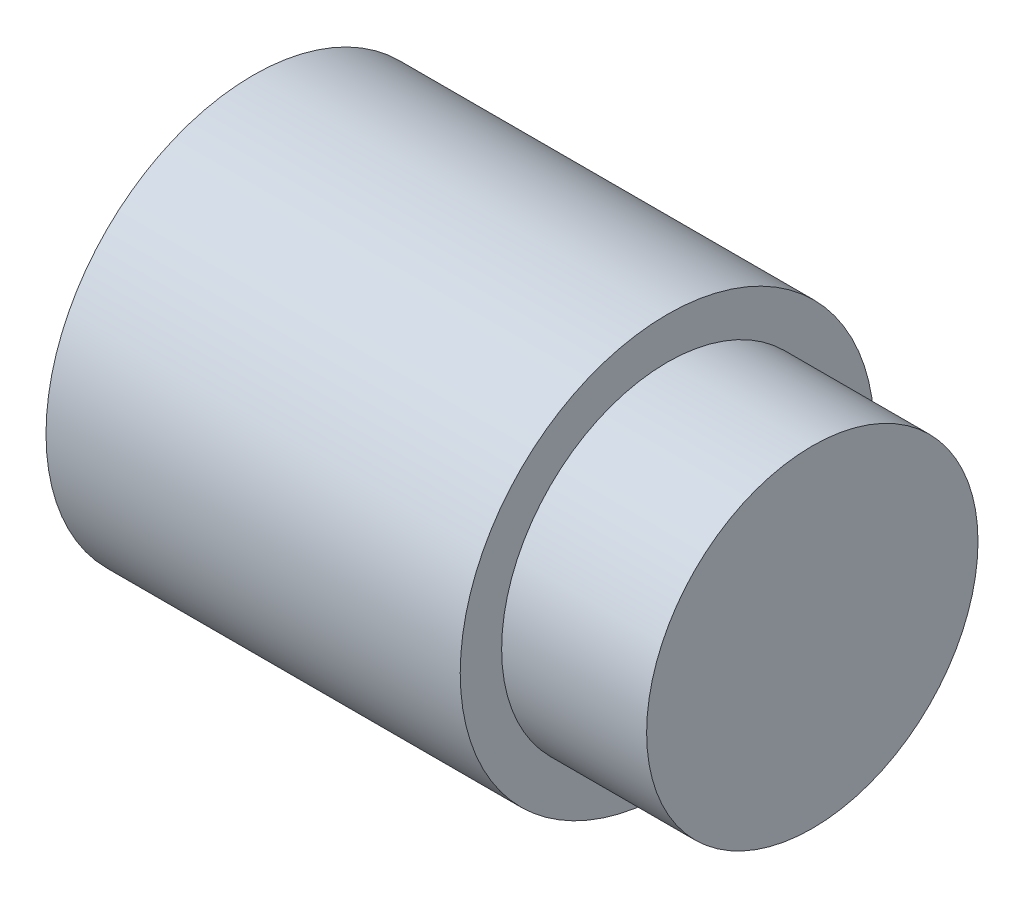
from build123d import *

# Parameters (mm, degrees)
SKETCH_1_R      = 50
EXTRUDE_1_DEPTH = 100
SKETCH_1_3_R    = 40
EXTRUDE_2_DEPTH = 35


with BuildPart() as part:
    # Sketch 1 → Extrude 1 (new body)
    with BuildSketch(Plane(origin=(0, 0, 0), x_dir=(0, 0, -1), z_dir=(1, 0, 0))):
        Circle(SKETCH_1_R)
    extrude(amount=-EXTRUDE_1_DEPTH)

    # Sketch 1_3 → Extrude 2 (add)
    with BuildSketch(Plane(origin=(0, 0, 0), x_dir=(0, 0, -1), z_dir=(1, 0, 0))):
        Circle(SKETCH_1_3_R)
    extrude(amount=EXTRUDE_2_DEPTH)


solid = part.part
